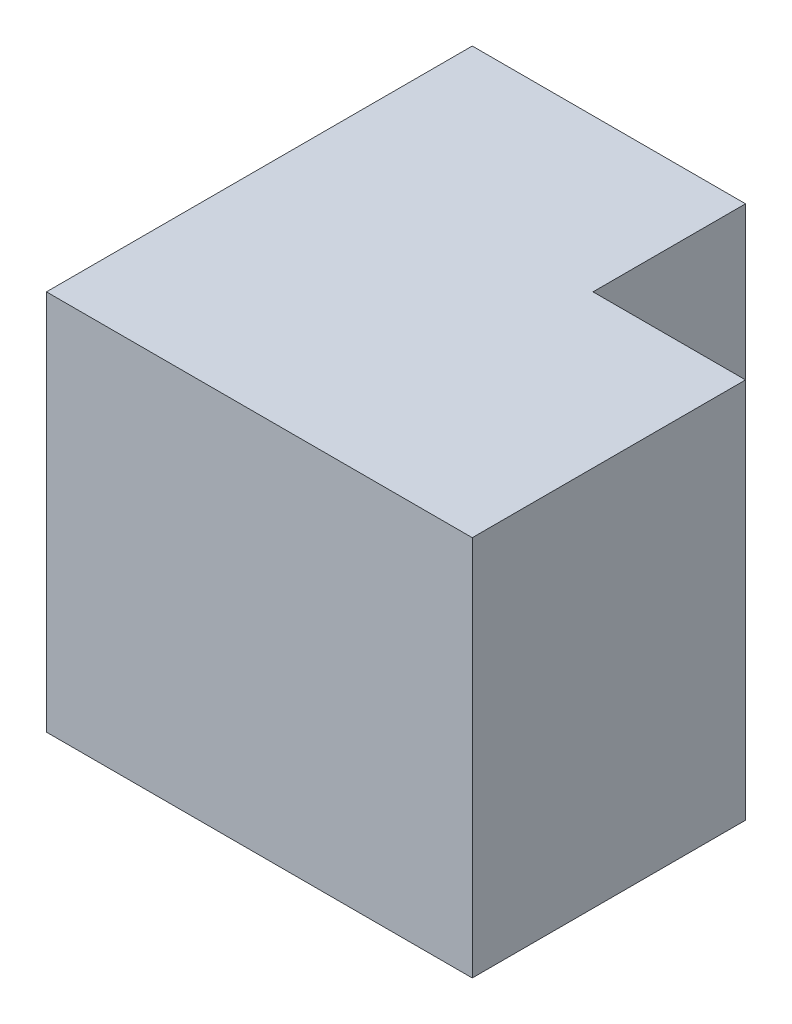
from build123d import *

# Parameters (mm, degrees)
BOSS_EXTRU_1_DEPTH = 60


with BuildPart() as part:
    # Esquisse1 → Boss.-Extru.1 (new body)
    with BuildSketch(Plane(origin=(0, 0, 0), x_dir=(1, 0, 0), z_dir=(0, 1, 0))):
        Polygon((9.5, 33.5), (-33.5, 33.5), (-33.5, -33.5), (33.5, -33.5), (33.5, 9.5), (9.5, 9.5), align=None)
    extrude(amount=BOSS_EXTRU_1_DEPTH)


solid = part.part
